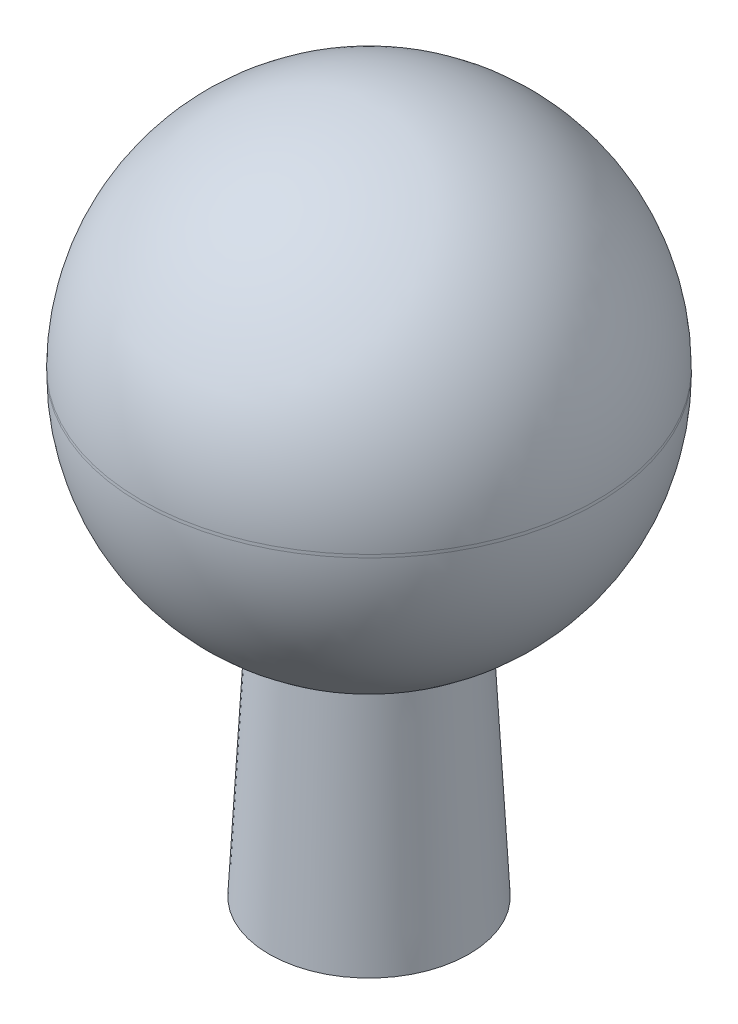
ISO-10303-21;
HEADER;
FILE_DESCRIPTION(('STEP AP214'),'2;1');
FILE_NAME('part.step','',(''),(''),'','','');
FILE_SCHEMA(('AUTOMOTIVE_DESIGN { 1 0 10303 214 1 1 1 1 }'));
ENDSEC;
DATA;
#1=APPLICATION_CONTEXT('core data for automotive mechanical design processes');
#2=APPLICATION_PROTOCOL_DEFINITION('international standard','automotive_design',2000,#1);
#3=PRODUCT_CONTEXT('',#1,'mechanical');
#4=PRODUCT('Part','Part','',(#3));
#5=PRODUCT_RELATED_PRODUCT_CATEGORY('part','',(#4));
#6=PRODUCT_DEFINITION_FORMATION('','',#4);
#7=PRODUCT_DEFINITION_CONTEXT('part definition',#1,'design');
#8=PRODUCT_DEFINITION('design','',#6,#7);
#9=PRODUCT_DEFINITION_SHAPE('','',#8);
#10=(LENGTH_UNIT() NAMED_UNIT(*) SI_UNIT(.MILLI.,.METRE.));
#11=(NAMED_UNIT(*) PLANE_ANGLE_UNIT() SI_UNIT($,.RADIAN.));
#12=(NAMED_UNIT(*) SI_UNIT($,.STERADIAN.) SOLID_ANGLE_UNIT());
#13=UNCERTAINTY_MEASURE_WITH_UNIT(LENGTH_MEASURE(1.E-05),#10,'distance_accuracy_value','');
#14=(GEOMETRIC_REPRESENTATION_CONTEXT(3) GLOBAL_UNCERTAINTY_ASSIGNED_CONTEXT((#13)) GLOBAL_UNIT_ASSIGNED_CONTEXT((#10,
#11,#12)) REPRESENTATION_CONTEXT('',''));
#15=CARTESIAN_POINT('',(0.,0.,0.));
#16=DIRECTION('',(0.,0.,1.));
#17=DIRECTION('',(1.,0.,0.));
#18=AXIS2_PLACEMENT_3D('',#15,#16,#17);
#19=CARTESIAN_POINT('',(0.,10.,0.));
#20=DIRECTION('',(0.,-1.,0.));
#21=DIRECTION('',(0.,0.,-1.));
#22=AXIS2_PLACEMENT_3D('',#19,#20,#21);
#23=CYLINDRICAL_SURFACE('',#22,1500.);
#24=CARTESIAN_POINT('',(0.,10.,0.));
#25=DIRECTION('',(0.,1.,0.));
#26=DIRECTION('',(0.,0.,1.));
#27=AXIS2_PLACEMENT_3D('',#24,#25,#26);
#28=CIRCLE('',#27,1500.);
#29=CARTESIAN_POINT('',(0.,10.,1500.));
#30=VERTEX_POINT('',#29);
#31=EDGE_CURVE('E38',#30,#30,#28,.T.);
#32=ORIENTED_EDGE('',*,*,#31,.F.);
#33=EDGE_LOOP('',(#32));
#34=FACE_BOUND('',#33,.T.);
#35=CARTESIAN_POINT('',(0.,-10.,0.));
#36=DIRECTION('',(0.,1.,0.));
#37=DIRECTION('',(0.,0.,1.));
#38=AXIS2_PLACEMENT_3D('',#35,#36,#37);
#39=CIRCLE('',#38,1500.);
#40=CARTESIAN_POINT('',(0.,-10.,1500.));
#41=VERTEX_POINT('',#40);
#42=EDGE_CURVE('E42',#41,#41,#39,.T.);
#43=ORIENTED_EDGE('',*,*,#42,.T.);
#44=EDGE_LOOP('',(#43));
#45=FACE_BOUND('',#44,.T.);
#46=ADVANCED_FACE('F31',(#34,#45),#23,.T.);
#47=CARTESIAN_POINT('',(0.,10.,0.));
#48=DIRECTION('',(0.,0.,1.));
#49=DIRECTION('',(1.,0.,0.));
#50=AXIS2_PLACEMENT_3D('',#47,#48,#49);
#51=SPHERICAL_SURFACE('',#50,1500.);
#52=CARTESIAN_POINT('',(0.,10.,0.));
#53=DIRECTION('',(0.,1.,0.));
#54=DIRECTION('',(0.,0.,1.));
#55=AXIS2_PLACEMENT_3D('',#52,#53,#54);
#56=SPHERICAL_SURFACE('',#55,1500.);
#57=ORIENTED_EDGE('',*,*,#31,.T.);
#58=EDGE_LOOP('',(#57));
#59=FACE_BOUND('',#58,.T.);
#60=ADVANCED_FACE('F33',(#59),#56,.T.);
#61=CARTESIAN_POINT('',(0.,-10.,0.));
#62=DIRECTION('',(0.,0.,1.));
#63=DIRECTION('',(1.,0.,0.));
#64=AXIS2_PLACEMENT_3D('',#61,#62,#63);
#65=SPHERICAL_SURFACE('',#64,1500.);
#66=CARTESIAN_POINT('',(0.,-10.,0.));
#67=DIRECTION('',(0.,1.,0.));
#68=DIRECTION('',(0.,0.,1.));
#69=AXIS2_PLACEMENT_3D('',#66,#67,#68);
#70=SPHERICAL_SURFACE('',#69,1500.);
#71=CARTESIAN_POINT('',(0.,-1396.17306742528,0.));
#72=DIRECTION('',(0.,1.,0.));
#73=DIRECTION('',(0.,0.,1.));
#74=AXIS2_PLACEMENT_3D('',#71,#72,#73);
#75=CIRCLE('',#74,573.17032995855);
#76=CARTESIAN_POINT('',(0.,-1396.17306742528,573.17032995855));
#77=VERTEX_POINT('',#76);
#78=EDGE_CURVE('E10',#77,#77,#75,.F.);
#79=ORIENTED_EDGE('',*,*,#78,.F.);
#80=EDGE_LOOP('',(#79));
#81=FACE_BOUND('',#80,.T.);
#82=ORIENTED_EDGE('',*,*,#42,.F.);
#83=EDGE_LOOP('',(#82));
#84=FACE_BOUND('',#83,.T.);
#85=ADVANCED_FACE('F60',(#81,#84),#70,.T.);
#86=CARTESIAN_POINT('',(0.,0.,0.));
#87=DIRECTION('',(0.,-1.,0.));
#88=DIRECTION('',(0.,0.,1.));
#89=AXIS2_PLACEMENT_3D('',#86,#87,#88);
#90=CONICAL_SURFACE('',#89,500.,0.0523598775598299);
#91=ORIENTED_EDGE('',*,*,#78,.T.);
#92=EDGE_LOOP('',(#91));
#93=FACE_BOUND('',#92,.T.);
#94=CARTESIAN_POINT('',(0.,-3000.,0.));
#95=DIRECTION('',(0.,1.,0.));
#96=DIRECTION('',(0.,0.,1.));
#97=AXIS2_PLACEMENT_3D('',#94,#95,#96);
#98=CIRCLE('',#97,657.223337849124);
#99=CARTESIAN_POINT('',(0.,-3000.,657.223337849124));
#100=VERTEX_POINT('',#99);
#101=EDGE_CURVE('E46',#100,#100,#98,.T.);
#102=ORIENTED_EDGE('',*,*,#101,.T.);
#103=EDGE_LOOP('',(#102));
#104=FACE_BOUND('',#103,.T.);
#105=ADVANCED_FACE('F52',(#93,#104),#90,.T.);
#106=CARTESIAN_POINT('',(0.,-3000.,0.));
#107=DIRECTION('',(0.,1.,0.));
#108=DIRECTION('',(0.,0.,1.));
#109=AXIS2_PLACEMENT_3D('',#106,#107,#108);
#110=PLANE('',#109);
#111=ORIENTED_EDGE('',*,*,#101,.F.);
#112=EDGE_LOOP('',(#111));
#113=FACE_BOUND('',#112,.T.);
#114=ADVANCED_FACE('F54',(#113),#110,.F.);
#115=CLOSED_SHELL('',(#46,#60,#85,#105,#114));
#116=MANIFOLD_SOLID_BREP('B2',#115);
#117=ADVANCED_BREP_SHAPE_REPRESENTATION('',(#18,#116),#14);
#118=SHAPE_DEFINITION_REPRESENTATION(#9,#117);
ENDSEC;
END-ISO-10303-21;
